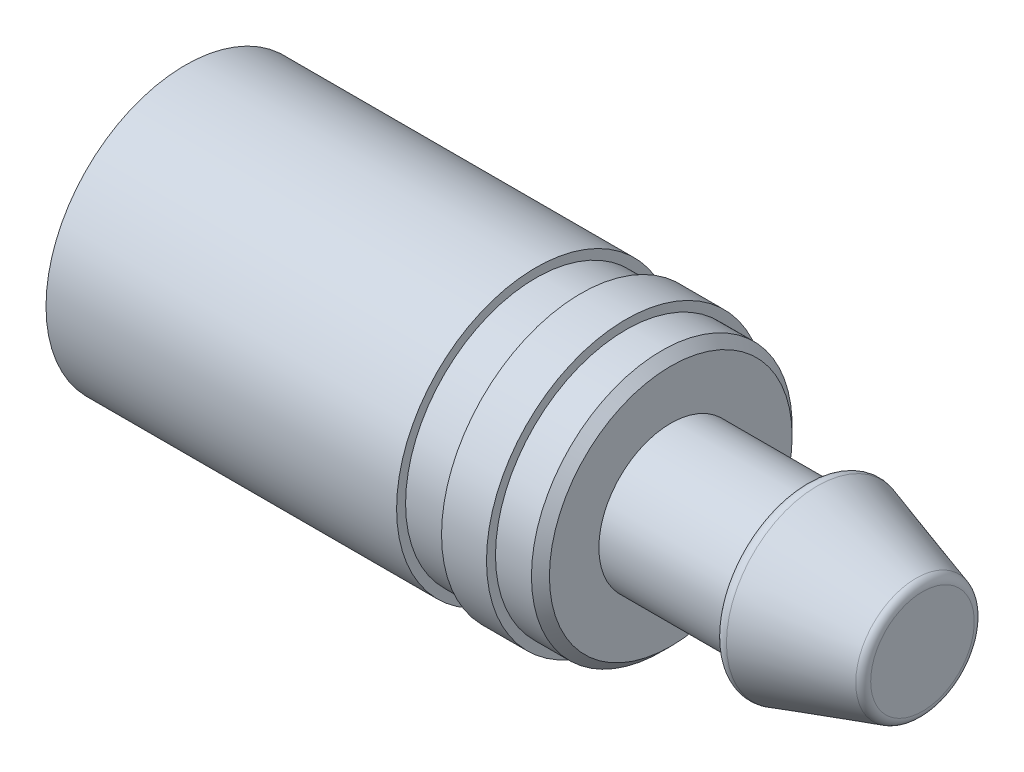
from build123d import *

# Parameters (mm, degrees)
REDONDEO1_R   = 1
CHAFL_N1_SIZE = 1


with BuildPart() as part:
    # Croquis1 → Revoluci_n1 (revolve)
    with BuildSketch(Plane.XY, mode=Mode.PRIVATE) as revoluci_n1_sk:
        Polygon((0, 0), (0, 15.5), (39, 15.5), (39, 14.5), (44, 14.5), (44, 15.5), (49, 15.5), (49, 14.5), (54, 14.5), (54, 8), (69, 8), (69, 10.5), (82, 6.5), (82, 0), align=None)
    revolve(revoluci_n1_sk.sketch.rotate(Axis((0, 0, 0), (1, 0, 0)), 90), axis=Axis((0, 0, 0), (1, 0, 0)))

    # Redondeo1
    redondeo1_edges = [part.edges().sort_by_distance(p)[0] for p in [
        (69, 0, -10.5),
        (82, 0, -6.5),
    ]]
    fillet(redondeo1_edges, radius=REDONDEO1_R)

    # Chafl_n1
    chafl_n1_edges = [part.edges().sort_by_distance(p)[0] for p in [
        (54, 0, -14.5),
    ]]
    chamfer(chafl_n1_edges, length=CHAFL_N1_SIZE)


solid = part.part
